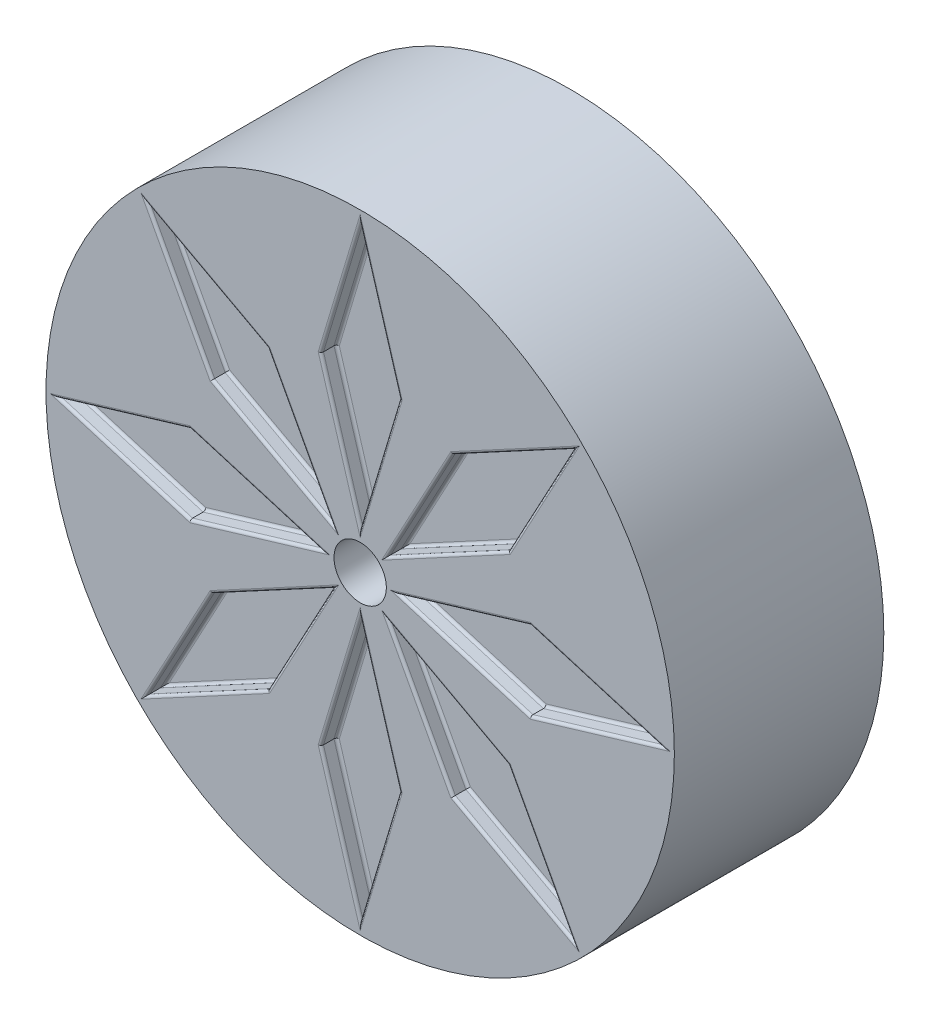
from build123d import *

# Parameters (mm, degrees)
SKETCH1_R                = 152.4
SKETCH1_R_2              = 12.7
BOSS_EXTRUDE1_DEPTH      = 101.6
CUT_EXTRUDE1_DEPTH       = 7.62
FILLET1_R                = 1.27
CIRPATTERN1_COUNT        = 8
FILLET1_OF_CIRPATTERN1_R = 1.27


with BuildPart() as part:
    # Sketch1 → Boss-Extrude1 (new body)
    with BuildSketch(Plane.XY):
        Circle(SKETCH1_R)
        Circle(SKETCH1_R_2, mode=Mode.SUBTRACT)
    extrude(amount=BOSS_EXTRUDE1_DEPTH)

    # Sketch2 → Cut-Extrude1 (cut)
    with BuildSketch(Plane.XY.offset(101.6)):
        Polygon((0, 19.05), (19.05, 82.55), (0, 146.05), (-19.05, 82.55), align=None)
    cut_extrude1 = extrude(amount=-CUT_EXTRUDE1_DEPTH, mode=Mode.SUBTRACT)

    # Fillet1
    fillet1_edges = [part.edges().sort_by_distance(p)[0] for p in [
        (-9.525, 50.8, 93.98),
        (-9.525, 114.3, 93.98),
        (9.525, 114.3, 93.98),
        (9.525, 50.8, 93.98),
        (-9.525, 50.8, 101.6),
        (9.525, 50.8, 101.6),
        (9.525, 114.3, 101.6),
        (-9.525, 114.3, 101.6),
    ]]
    fillet(fillet1_edges, radius=FILLET1_R)

    # CirPattern1: Cut-Extrude1 ×8 about axis
    cirpattern1_axis = Axis((0, 0, 0), (0, 0, 1))
    for i in range(1, CIRPATTERN1_COUNT):
        add(cut_extrude1.rotate(cirpattern1_axis, i * 360 / CIRPATTERN1_COUNT), mode=Mode.SUBTRACT)

    # Fillet1 of CirPattern1
    fillet1_of_cirpattern1_edges = [part.edges().sort_by_distance(p)[0] for p in [
        (-42.656216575, 29.185832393, 93.98),
        (-87.55749718, 74.087112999, 93.98),
        (-74.087112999, 87.55749718, 93.98),
        (-29.185832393, 42.656216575, 93.98),
        (-42.656216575, 29.185832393, 101.6),
        (-29.185832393, 42.656216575, 101.6),
        (-74.087112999, 87.55749718, 101.6),
        (-87.55749718, 74.087112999, 101.6),
        (-50.8, -9.525, 93.98),
        (-114.3, -9.525, 93.98),
        (-114.3, 9.525, 93.98),
        (-50.8, 9.525, 93.98),
        (-50.8, -9.525, 101.6),
        (-50.8, 9.525, 101.6),
        (-114.3, 9.525, 101.6),
        (-114.3, -9.525, 101.6),
        (-29.185832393, -42.656216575, 93.98),
        (-74.087112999, -87.55749718, 93.98),
        (-87.55749718, -74.087112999, 93.98),
        (-42.656216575, -29.185832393, 93.98),
        (-29.185832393, -42.656216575, 101.6),
        (-42.656216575, -29.185832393, 101.6),
        (-87.55749718, -74.087112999, 101.6),
        (-74.087112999, -87.55749718, 101.6),
        (9.525, -50.8, 93.98),
        (9.525, -114.3, 93.98),
        (-9.525, -114.3, 93.98),
        (-9.525, -50.8, 93.98),
        (9.525, -50.8, 101.6),
        (-9.525, -50.8, 101.6),
        (-9.525, -114.3, 101.6),
        (9.525, -114.3, 101.6),
        (42.656216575, -29.185832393, 93.98),
        (87.55749718, -74.087112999, 93.98),
        (74.087112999, -87.55749718, 93.98),
        (29.185832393, -42.656216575, 93.98),
        (42.656216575, -29.185832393, 101.6),
        (29.185832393, -42.656216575, 101.6),
        (74.087112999, -87.55749718, 101.6),
        (87.55749718, -74.087112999, 101.6),
        (50.8, 9.525, 93.98),
        (114.3, 9.525, 93.98),
        (114.3, -9.525, 93.98),
        (50.8, -9.525, 93.98),
        (50.8, 9.525, 101.6),
        (50.8, -9.525, 101.6),
        (114.3, -9.525, 101.6),
        (114.3, 9.525, 101.6),
        (29.185832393, 42.656216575, 93.98),
        (74.087112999, 87.55749718, 93.98),
        (87.55749718, 74.087112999, 93.98),
        (42.656216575, 29.185832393, 93.98),
        (29.185832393, 42.656216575, 101.6),
        (42.656216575, 29.185832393, 101.6),
        (87.55749718, 74.087112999, 101.6),
        (74.087112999, 87.55749718, 101.6),
    ]]
    fillet(fillet1_of_cirpattern1_edges, radius=FILLET1_OF_CIRPATTERN1_R)


solid = part.part
